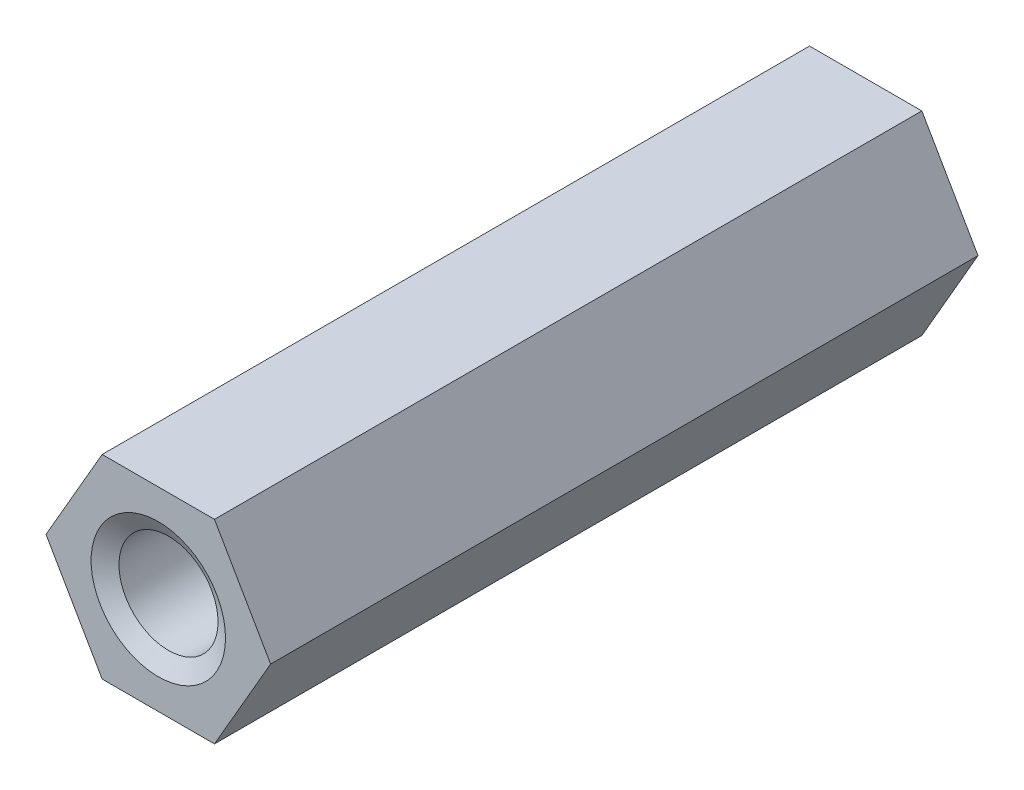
ISO-10303-21;
HEADER;
FILE_DESCRIPTION(('STEP AP214'),'2;1');
FILE_NAME('part.step','',(''),(''),'','','');
FILE_SCHEMA(('AUTOMOTIVE_DESIGN { 1 0 10303 214 1 1 1 1 }'));
ENDSEC;
DATA;
#1=APPLICATION_CONTEXT('core data for automotive mechanical design processes');
#2=APPLICATION_PROTOCOL_DEFINITION('international standard','automotive_design',2000,#1);
#3=PRODUCT_CONTEXT('',#1,'mechanical');
#4=PRODUCT('Part','Part','',(#3));
#5=PRODUCT_RELATED_PRODUCT_CATEGORY('part','',(#4));
#6=PRODUCT_DEFINITION_FORMATION('','',#4);
#7=PRODUCT_DEFINITION_CONTEXT('part definition',#1,'design');
#8=PRODUCT_DEFINITION('design','',#6,#7);
#9=PRODUCT_DEFINITION_SHAPE('','',#8);
#10=(LENGTH_UNIT() NAMED_UNIT(*) SI_UNIT(.MILLI.,.METRE.));
#11=(NAMED_UNIT(*) PLANE_ANGLE_UNIT() SI_UNIT($,.RADIAN.));
#12=(NAMED_UNIT(*) SI_UNIT($,.STERADIAN.) SOLID_ANGLE_UNIT());
#13=UNCERTAINTY_MEASURE_WITH_UNIT(LENGTH_MEASURE(1.E-05),#10,'distance_accuracy_value','');
#14=(GEOMETRIC_REPRESENTATION_CONTEXT(3) GLOBAL_UNCERTAINTY_ASSIGNED_CONTEXT((#13)) GLOBAL_UNIT_ASSIGNED_CONTEXT((#10,
#11,#12)) REPRESENTATION_CONTEXT('',''));
#15=CARTESIAN_POINT('',(0.,0.,0.));
#16=DIRECTION('',(0.,0.,1.));
#17=DIRECTION('',(1.,0.,0.));
#18=AXIS2_PLACEMENT_3D('',#15,#16,#17);
#19=CARTESIAN_POINT('',(3.17542648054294,0.,10.));
#20=DIRECTION('',(-0.866025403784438,-0.5,0.));
#21=DIRECTION('',(0.5,-0.866025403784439,0.));
#22=AXIS2_PLACEMENT_3D('',#19,#20,#21);
#23=PLANE('',#22);
#24=DIRECTION('',(-0.5,0.866025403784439,0.));
#25=VECTOR('',#24,1.);
#26=CARTESIAN_POINT('',(3.17542648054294,0.,-10.));
#27=LINE('',#26,#25);
#28=CARTESIAN_POINT('',(3.17542648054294,0.,-10.));
#29=VERTEX_POINT('',#28);
#30=CARTESIAN_POINT('',(1.58771324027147,2.75,-10.));
#31=VERTEX_POINT('',#30);
#32=EDGE_CURVE('E132',#29,#31,#27,.T.);
#33=ORIENTED_EDGE('',*,*,#32,.T.);
#34=DIRECTION('',(0.,0.,-1.));
#35=VECTOR('',#34,1.);
#36=CARTESIAN_POINT('',(1.58771324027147,2.75,10.));
#37=LINE('',#36,#35);
#38=CARTESIAN_POINT('',(1.58771324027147,2.75,10.));
#39=VERTEX_POINT('',#38);
#40=EDGE_CURVE('E150',#39,#31,#37,.T.);
#41=ORIENTED_EDGE('',*,*,#40,.F.);
#42=DIRECTION('',(-0.5,0.866025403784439,0.));
#43=VECTOR('',#42,1.);
#44=CARTESIAN_POINT('',(3.17542648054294,0.,10.));
#45=LINE('',#44,#43);
#46=CARTESIAN_POINT('',(3.17542648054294,0.,10.));
#47=VERTEX_POINT('',#46);
#48=EDGE_CURVE('E143',#47,#39,#45,.T.);
#49=ORIENTED_EDGE('',*,*,#48,.F.);
#50=DIRECTION('',(0.,0.,-1.));
#51=VECTOR('',#50,1.);
#52=CARTESIAN_POINT('',(3.17542648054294,0.,10.));
#53=LINE('',#52,#51);
#54=EDGE_CURVE('E128',#47,#29,#53,.T.);
#55=ORIENTED_EDGE('',*,*,#54,.T.);
#56=EDGE_LOOP('',(#33,#41,#49,#55));
#57=FACE_BOUND('',#56,.T.);
#58=ADVANCED_FACE('F46',(#57),#23,.F.);
#59=CARTESIAN_POINT('',(1.58771324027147,2.75,10.));
#60=DIRECTION('',(0.,-1.,0.));
#61=DIRECTION('',(0.,0.,-1.));
#62=AXIS2_PLACEMENT_3D('',#59,#60,#61);
#63=PLANE('',#62);
#64=DIRECTION('',(-1.,0.,0.));
#65=VECTOR('',#64,1.);
#66=CARTESIAN_POINT('',(1.58771324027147,2.75,-10.));
#67=LINE('',#66,#65);
#68=CARTESIAN_POINT('',(-1.58771324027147,2.75,-10.));
#69=VERTEX_POINT('',#68);
#70=EDGE_CURVE('E135',#31,#69,#67,.T.);
#71=ORIENTED_EDGE('',*,*,#70,.T.);
#72=DIRECTION('',(0.,0.,-1.));
#73=VECTOR('',#72,1.);
#74=CARTESIAN_POINT('',(-1.58771324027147,2.75,10.));
#75=LINE('',#74,#73);
#76=CARTESIAN_POINT('',(-1.58771324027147,2.75,10.));
#77=VERTEX_POINT('',#76);
#78=EDGE_CURVE('E147',#77,#69,#75,.T.);
#79=ORIENTED_EDGE('',*,*,#78,.F.);
#80=DIRECTION('',(-1.,0.,0.));
#81=VECTOR('',#80,1.);
#82=CARTESIAN_POINT('',(1.58771324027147,2.75,10.));
#83=LINE('',#82,#81);
#84=EDGE_CURVE('E101',#39,#77,#83,.T.);
#85=ORIENTED_EDGE('',*,*,#84,.F.);
#86=ORIENTED_EDGE('',*,*,#40,.T.);
#87=EDGE_LOOP('',(#71,#79,#85,#86));
#88=FACE_BOUND('',#87,.T.);
#89=ADVANCED_FACE('F179',(#88),#63,.F.);
#90=CARTESIAN_POINT('',(-1.58771324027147,2.75,10.));
#91=DIRECTION('',(0.866025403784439,-0.5,0.));
#92=DIRECTION('',(0.5,0.866025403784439,0.));
#93=AXIS2_PLACEMENT_3D('',#90,#91,#92);
#94=PLANE('',#93);
#95=DIRECTION('',(-0.5,-0.866025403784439,0.));
#96=VECTOR('',#95,1.);
#97=CARTESIAN_POINT('',(-1.58771324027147,2.75,-10.));
#98=LINE('',#97,#96);
#99=CARTESIAN_POINT('',(-3.17542648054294,0.,-10.));
#100=VERTEX_POINT('',#99);
#101=EDGE_CURVE('E138',#69,#100,#98,.T.);
#102=ORIENTED_EDGE('',*,*,#101,.T.);
#103=DIRECTION('',(0.,0.,-1.));
#104=VECTOR('',#103,1.);
#105=CARTESIAN_POINT('',(-3.17542648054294,0.,10.));
#106=LINE('',#105,#104);
#107=CARTESIAN_POINT('',(-3.17542648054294,0.,10.));
#108=VERTEX_POINT('',#107);
#109=EDGE_CURVE('E123',#108,#100,#106,.T.);
#110=ORIENTED_EDGE('',*,*,#109,.F.);
#111=DIRECTION('',(-0.5,-0.866025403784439,0.));
#112=VECTOR('',#111,1.);
#113=CARTESIAN_POINT('',(-1.58771324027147,2.75,10.));
#114=LINE('',#113,#112);
#115=EDGE_CURVE('E114',#77,#108,#114,.T.);
#116=ORIENTED_EDGE('',*,*,#115,.F.);
#117=ORIENTED_EDGE('',*,*,#78,.T.);
#118=EDGE_LOOP('',(#102,#110,#116,#117));
#119=FACE_BOUND('',#118,.T.);
#120=ADVANCED_FACE('F185',(#119),#94,.F.);
#121=CARTESIAN_POINT('',(-3.17542648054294,0.,10.));
#122=DIRECTION('',(0.866025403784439,0.5,0.));
#123=DIRECTION('',(-0.5,0.866025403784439,0.));
#124=AXIS2_PLACEMENT_3D('',#121,#122,#123);
#125=PLANE('',#124);
#126=DIRECTION('',(0.5,-0.866025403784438,0.));
#127=VECTOR('',#126,1.);
#128=CARTESIAN_POINT('',(-3.17542648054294,0.,-10.));
#129=LINE('',#128,#127);
#130=CARTESIAN_POINT('',(-1.58771324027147,-2.75,-10.));
#131=VERTEX_POINT('',#130);
#132=EDGE_CURVE('E122',#100,#131,#129,.T.);
#133=ORIENTED_EDGE('',*,*,#132,.T.);
#134=DIRECTION('',(0.,0.,-1.));
#135=VECTOR('',#134,1.);
#136=CARTESIAN_POINT('',(-1.58771324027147,-2.75,10.));
#137=LINE('',#136,#135);
#138=CARTESIAN_POINT('',(-1.58771324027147,-2.75,10.));
#139=VERTEX_POINT('',#138);
#140=EDGE_CURVE('E119',#139,#131,#137,.T.);
#141=ORIENTED_EDGE('',*,*,#140,.F.);
#142=DIRECTION('',(0.5,-0.866025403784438,0.));
#143=VECTOR('',#142,1.);
#144=CARTESIAN_POINT('',(-3.17542648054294,0.,10.));
#145=LINE('',#144,#143);
#146=EDGE_CURVE('E108',#108,#139,#145,.T.);
#147=ORIENTED_EDGE('',*,*,#146,.F.);
#148=ORIENTED_EDGE('',*,*,#109,.T.);
#149=EDGE_LOOP('',(#133,#141,#147,#148));
#150=FACE_BOUND('',#149,.T.);
#151=ADVANCED_FACE('F120',(#150),#125,.F.);
#152=CARTESIAN_POINT('',(-1.58771324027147,-2.75,10.));
#153=DIRECTION('',(0.,1.,0.));
#154=DIRECTION('',(-1.,0.,0.));
#155=AXIS2_PLACEMENT_3D('',#152,#153,#154);
#156=PLANE('',#155);
#157=DIRECTION('',(1.,0.,0.));
#158=VECTOR('',#157,1.);
#159=CARTESIAN_POINT('',(-1.58771324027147,-2.75,-10.));
#160=LINE('',#159,#158);
#161=CARTESIAN_POINT('',(1.58771324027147,-2.75,-10.));
#162=VERTEX_POINT('',#161);
#163=EDGE_CURVE('E86',#131,#162,#160,.T.);
#164=ORIENTED_EDGE('',*,*,#163,.T.);
#165=DIRECTION('',(0.,0.,-1.));
#166=VECTOR('',#165,1.);
#167=CARTESIAN_POINT('',(1.58771324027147,-2.75,10.));
#168=LINE('',#167,#166);
#169=CARTESIAN_POINT('',(1.58771324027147,-2.75,10.));
#170=VERTEX_POINT('',#169);
#171=EDGE_CURVE('E124',#170,#162,#168,.T.);
#172=ORIENTED_EDGE('',*,*,#171,.F.);
#173=DIRECTION('',(1.,0.,0.));
#174=VECTOR('',#173,1.);
#175=CARTESIAN_POINT('',(-1.58771324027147,-2.75,10.));
#176=LINE('',#175,#174);
#177=EDGE_CURVE('E112',#139,#170,#176,.T.);
#178=ORIENTED_EDGE('',*,*,#177,.F.);
#179=ORIENTED_EDGE('',*,*,#140,.T.);
#180=EDGE_LOOP('',(#164,#172,#178,#179));
#181=FACE_BOUND('',#180,.T.);
#182=ADVANCED_FACE('F126',(#181),#156,.F.);
#183=CARTESIAN_POINT('',(1.58771324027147,-2.75,10.));
#184=DIRECTION('',(-0.866025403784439,0.5,0.));
#185=DIRECTION('',(-0.5,-0.866025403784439,0.));
#186=AXIS2_PLACEMENT_3D('',#183,#184,#185);
#187=PLANE('',#186);
#188=DIRECTION('',(0.5,0.866025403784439,0.));
#189=VECTOR('',#188,1.);
#190=CARTESIAN_POINT('',(1.58771324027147,-2.75,-10.));
#191=LINE('',#190,#189);
#192=EDGE_CURVE('E92',#162,#29,#191,.T.);
#193=ORIENTED_EDGE('',*,*,#192,.T.);
#194=ORIENTED_EDGE('',*,*,#54,.F.);
#195=DIRECTION('',(0.5,0.866025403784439,0.));
#196=VECTOR('',#195,1.);
#197=CARTESIAN_POINT('',(1.58771324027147,-2.75,10.));
#198=LINE('',#197,#196);
#199=EDGE_CURVE('E63',#170,#47,#198,.T.);
#200=ORIENTED_EDGE('',*,*,#199,.F.);
#201=ORIENTED_EDGE('',*,*,#171,.T.);
#202=EDGE_LOOP('',(#193,#194,#200,#201));
#203=FACE_BOUND('',#202,.T.);
#204=ADVANCED_FACE('F216',(#203),#187,.F.);
#205=CARTESIAN_POINT('',(0.,0.,10.));
#206=DIRECTION('',(0.,0.,1.));
#207=DIRECTION('',(1.,0.,0.));
#208=AXIS2_PLACEMENT_3D('',#205,#206,#207);
#209=PLANE('',#208);
#210=CARTESIAN_POINT('',(0.,0.,10.));
#211=DIRECTION('',(0.,0.,1.));
#212=DIRECTION('',(1.,0.,0.));
#213=AXIS2_PLACEMENT_3D('',#210,#211,#212);
#214=CIRCLE('',#213,1.9);
#215=CARTESIAN_POINT('',(1.9,0.,10.));
#216=VERTEX_POINT('',#215);
#217=EDGE_CURVE('E13',#216,#216,#214,.F.);
#218=ORIENTED_EDGE('',*,*,#217,.T.);
#219=EDGE_LOOP('',(#218));
#220=FACE_BOUND('',#219,.T.);
#221=ORIENTED_EDGE('',*,*,#48,.T.);
#222=ORIENTED_EDGE('',*,*,#84,.T.);
#223=ORIENTED_EDGE('',*,*,#115,.T.);
#224=ORIENTED_EDGE('',*,*,#146,.T.);
#225=ORIENTED_EDGE('',*,*,#177,.T.);
#226=ORIENTED_EDGE('',*,*,#199,.T.);
#227=EDGE_LOOP('',(#221,#222,#223,#224,#225,#226));
#228=FACE_BOUND('',#227,.T.);
#229=ADVANCED_FACE('F110',(#220,#228),#209,.T.);
#230=CARTESIAN_POINT('',(0.,0.,-10.));
#231=DIRECTION('',(0.,0.,1.));
#232=DIRECTION('',(1.,0.,0.));
#233=AXIS2_PLACEMENT_3D('',#230,#231,#232);
#234=PLANE('',#233);
#235=CARTESIAN_POINT('',(0.,0.,-10.));
#236=DIRECTION('',(0.,0.,1.));
#237=DIRECTION('',(1.,0.,0.));
#238=AXIS2_PLACEMENT_3D('',#235,#236,#237);
#239=CIRCLE('',#238,1.68867513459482);
#240=CARTESIAN_POINT('',(1.68867513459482,0.,-10.));
#241=VERTEX_POINT('',#240);
#242=EDGE_CURVE('E158',#241,#241,#239,.T.);
#243=ORIENTED_EDGE('',*,*,#242,.T.);
#244=EDGE_LOOP('',(#243));
#245=FACE_BOUND('',#244,.T.);
#246=ORIENTED_EDGE('',*,*,#32,.F.);
#247=ORIENTED_EDGE('',*,*,#192,.F.);
#248=ORIENTED_EDGE('',*,*,#163,.F.);
#249=ORIENTED_EDGE('',*,*,#132,.F.);
#250=ORIENTED_EDGE('',*,*,#101,.F.);
#251=ORIENTED_EDGE('',*,*,#70,.F.);
#252=EDGE_LOOP('',(#246,#247,#248,#249,#250,#251));
#253=FACE_BOUND('',#252,.T.);
#254=ADVANCED_FACE('F211',(#245,#253),#234,.F.);
#255=CARTESIAN_POINT('',(0.,0.,4.));
#256=DIRECTION('',(0.,0.,1.));
#257=DIRECTION('',(1.,0.,0.));
#258=AXIS2_PLACEMENT_3D('',#255,#256,#257);
#259=CYLINDRICAL_SURFACE('',#258,1.4);
#260=CARTESIAN_POINT('',(0.,0.,9.71132486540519));
#261=DIRECTION('',(0.,0.,1.));
#262=DIRECTION('',(1.,0.,0.));
#263=AXIS2_PLACEMENT_3D('',#260,#261,#262);
#264=CIRCLE('',#263,1.4);
#265=CARTESIAN_POINT('',(1.4,0.,9.71132486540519));
#266=VERTEX_POINT('',#265);
#267=EDGE_CURVE('E55',#266,#266,#264,.T.);
#268=ORIENTED_EDGE('',*,*,#267,.T.);
#269=EDGE_LOOP('',(#268));
#270=FACE_BOUND('',#269,.T.);
#271=CARTESIAN_POINT('',(0.,0.,4.69282032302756));
#272=DIRECTION('',(0.,0.,1.));
#273=DIRECTION('',(1.,0.,0.));
#274=AXIS2_PLACEMENT_3D('',#271,#272,#273);
#275=CIRCLE('',#274,1.4);
#276=CARTESIAN_POINT('',(1.4,0.,4.69282032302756));
#277=VERTEX_POINT('',#276);
#278=EDGE_CURVE('E155',#277,#277,#275,.F.);
#279=ORIENTED_EDGE('',*,*,#278,.T.);
#280=EDGE_LOOP('',(#279));
#281=FACE_BOUND('',#280,.T.);
#282=ADVANCED_FACE('F166',(#270,#281),#259,.F.);
#283=CARTESIAN_POINT('',(0.,0.,4.));
#284=DIRECTION('',(0.,0.,1.));
#285=DIRECTION('',(1.,0.,0.));
#286=AXIS2_PLACEMENT_3D('',#283,#284,#285);
#287=PLANE('',#286);
#288=CARTESIAN_POINT('',(0.,0.,4.));
#289=DIRECTION('',(0.,0.,1.));
#290=DIRECTION('',(1.,0.,0.));
#291=AXIS2_PLACEMENT_3D('',#288,#289,#290);
#292=CIRCLE('',#291,0.199999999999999);
#293=CARTESIAN_POINT('',(0.199999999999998,0.,4.));
#294=VERTEX_POINT('',#293);
#295=EDGE_CURVE('E152',#294,#294,#292,.T.);
#296=ORIENTED_EDGE('',*,*,#295,.T.);
#297=EDGE_LOOP('',(#296));
#298=FACE_BOUND('',#297,.T.);
#299=ADVANCED_FACE('F202',(#298),#287,.T.);
#300=CARTESIAN_POINT('',(0.,0.,-4.));
#301=DIRECTION('',(0.,0.,-1.));
#302=DIRECTION('',(-1.,0.,0.));
#303=AXIS2_PLACEMENT_3D('',#300,#301,#302);
#304=CYLINDRICAL_SURFACE('',#303,1.4);
#305=CARTESIAN_POINT('',(0.,0.,-9.49999999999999));
#306=DIRECTION('',(0.,0.,1.));
#307=DIRECTION('',(1.,0.,0.));
#308=AXIS2_PLACEMENT_3D('',#305,#306,#307);
#309=CIRCLE('',#308,1.4);
#310=CARTESIAN_POINT('',(1.4,0.,-9.49999999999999));
#311=VERTEX_POINT('',#310);
#312=EDGE_CURVE('E161',#311,#311,#309,.F.);
#313=ORIENTED_EDGE('',*,*,#312,.T.);
#314=EDGE_LOOP('',(#313));
#315=FACE_BOUND('',#314,.T.);
#316=CARTESIAN_POINT('',(0.,0.,-4.));
#317=DIRECTION('',(0.,0.,1.));
#318=DIRECTION('',(1.,0.,0.));
#319=AXIS2_PLACEMENT_3D('',#316,#317,#318);
#320=CIRCLE('',#319,1.4);
#321=CARTESIAN_POINT('',(1.4,0.,-4.));
#322=VERTEX_POINT('',#321);
#323=EDGE_CURVE('E136',#322,#322,#320,.T.);
#324=ORIENTED_EDGE('',*,*,#323,.T.);
#325=EDGE_LOOP('',(#324));
#326=FACE_BOUND('',#325,.T.);
#327=ADVANCED_FACE('F195',(#315,#326),#304,.F.);
#328=CARTESIAN_POINT('',(0.,0.,-4.));
#329=DIRECTION('',(0.,0.,-1.));
#330=DIRECTION('',(1.,0.,0.));
#331=AXIS2_PLACEMENT_3D('',#328,#329,#330);
#332=PLANE('',#331);
#333=ORIENTED_EDGE('',*,*,#323,.F.);
#334=EDGE_LOOP('',(#333));
#335=FACE_BOUND('',#334,.T.);
#336=ADVANCED_FACE('F190',(#335),#332,.T.);
#337=CARTESIAN_POINT('',(0.,0.,4.));
#338=DIRECTION('',(0.,0.,1.));
#339=DIRECTION('',(1.,0.,0.));
#340=AXIS2_PLACEMENT_3D('',#337,#338,#339);
#341=CONICAL_SURFACE('',#340,0.199999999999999,1.04719755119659);
#342=CARTESIAN_POINT('',(1.4,0.,4.69282032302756));
#343=CARTESIAN_POINT('',(1.3875,0.,4.68560344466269));
#344=CARTESIAN_POINT('',(1.375,0.,4.67838656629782));
#345=CARTESIAN_POINT('',(1.35,0.,4.66395280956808));
#346=CARTESIAN_POINT('',(1.3375,0.,4.65673593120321));
#347=CARTESIAN_POINT('',(1.3125,0.,4.64230217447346));
#348=CARTESIAN_POINT('',(1.3,0.,4.63508529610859));
#349=CARTESIAN_POINT('',(1.275,0.,4.62065153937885));
#350=CARTESIAN_POINT('',(1.2625,0.,4.61343466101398));
#351=CARTESIAN_POINT('',(1.2375,0.,4.59900090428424));
#352=CARTESIAN_POINT('',(1.225,0.,4.59178402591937));
#353=CARTESIAN_POINT('',(1.2,0.,4.57735026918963));
#354=CARTESIAN_POINT('',(1.1875,0.,4.57013339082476));
#355=CARTESIAN_POINT('',(1.1625,0.,4.55569963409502));
#356=CARTESIAN_POINT('',(1.15,0.,4.54848275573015));
#357=CARTESIAN_POINT('',(1.125,0.,4.53404899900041));
#358=CARTESIAN_POINT('',(1.1125,0.,4.52683212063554));
#359=CARTESIAN_POINT('',(1.0875,0.,4.5123983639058));
#360=CARTESIAN_POINT('',(1.075,0.,4.50518148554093));
#361=CARTESIAN_POINT('',(1.05,0.,4.49074772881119));
#362=CARTESIAN_POINT('',(1.0375,0.,4.48353085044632));
#363=CARTESIAN_POINT('',(1.0125,0.,4.46909709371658));
#364=CARTESIAN_POINT('',(0.999999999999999,0.,4.46188021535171));
#365=CARTESIAN_POINT('',(0.974999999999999,0.,4.44744645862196));
#366=CARTESIAN_POINT('',(0.962499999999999,0.,4.44022958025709));
#367=CARTESIAN_POINT('',(0.937499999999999,0.,4.42579582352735));
#368=CARTESIAN_POINT('',(0.924999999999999,0.,4.41857894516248));
#369=CARTESIAN_POINT('',(0.899999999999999,0.,4.40414518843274));
#370=CARTESIAN_POINT('',(0.887499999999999,0.,4.39692831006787));
#371=CARTESIAN_POINT('',(0.862499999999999,0.,4.38249455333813));
#372=CARTESIAN_POINT('',(0.849999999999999,0.,4.37527767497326));
#373=CARTESIAN_POINT('',(0.824999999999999,0.,4.36084391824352));
#374=CARTESIAN_POINT('',(0.812499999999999,0.,4.35362703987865));
#375=CARTESIAN_POINT('',(0.787499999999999,0.,4.33919328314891));
#376=CARTESIAN_POINT('',(0.774999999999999,0.,4.33197640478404));
#377=CARTESIAN_POINT('',(0.749999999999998,0.,4.3175426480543));
#378=CARTESIAN_POINT('',(0.737499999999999,0.,4.31032576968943));
#379=CARTESIAN_POINT('',(0.712499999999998,0.,4.29589201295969));
#380=CARTESIAN_POINT('',(0.699999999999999,0.,4.28867513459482));
#381=CARTESIAN_POINT('',(0.674999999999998,0.,4.27424137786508));
#382=CARTESIAN_POINT('',(0.662499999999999,0.,4.2670244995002));
#383=CARTESIAN_POINT('',(0.637499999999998,0.,4.25259074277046));
#384=CARTESIAN_POINT('',(0.624999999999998,0.,4.24537386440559));
#385=CARTESIAN_POINT('',(0.599999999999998,0.,4.23094010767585));
#386=CARTESIAN_POINT('',(0.587499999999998,0.,4.22372322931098));
#387=CARTESIAN_POINT('',(0.562499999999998,0.,4.20928947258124));
#388=CARTESIAN_POINT('',(0.549999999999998,0.,4.20207259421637));
#389=CARTESIAN_POINT('',(0.524999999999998,0.,4.18763883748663));
#390=CARTESIAN_POINT('',(0.512499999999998,0.,4.18042195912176));
#391=CARTESIAN_POINT('',(0.487499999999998,0.,4.16598820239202));
#392=CARTESIAN_POINT('',(0.474999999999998,0.,4.15877132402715));
#393=CARTESIAN_POINT('',(0.449999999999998,0.,4.14433756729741));
#394=CARTESIAN_POINT('',(0.437499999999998,0.,4.13712068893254));
#395=CARTESIAN_POINT('',(0.412499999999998,0.,4.1226869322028));
#396=CARTESIAN_POINT('',(0.399999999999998,0.,4.11547005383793));
#397=CARTESIAN_POINT('',(0.374999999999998,0.,4.10103629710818));
#398=CARTESIAN_POINT('',(0.362499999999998,0.,4.09381941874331));
#399=CARTESIAN_POINT('',(0.337499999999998,0.,4.07938566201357));
#400=CARTESIAN_POINT('',(0.324999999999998,0.,4.0721687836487));
#401=CARTESIAN_POINT('',(0.299999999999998,0.,4.05773502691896));
#402=CARTESIAN_POINT('',(0.287499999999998,0.,4.05051814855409));
#403=CARTESIAN_POINT('',(0.262499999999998,0.,4.03608439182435));
#404=CARTESIAN_POINT('',(0.249999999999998,0.,4.02886751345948));
#405=CARTESIAN_POINT('',(0.224999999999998,0.,4.01443375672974));
#406=CARTESIAN_POINT('',(0.212499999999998,0.,4.00721687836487));
#407=CARTESIAN_POINT('',(0.199999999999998,0.,4.));
#408=B_SPLINE_CURVE_WITH_KNOTS('',3,(#342,#343,#344,#345,#346,#347,#348,#349,#350,#351,#352,
#353,#354,#355,#356,#357,#358,#359,#360,#361,#362,#363,#364,#365,#366,#367,#368,#369,#370,#371,
#372,#373,#374,#375,#376,#377,#378,#379,#380,#381,#382,#383,#384,#385,#386,#387,#388,#389,#390,
#391,#392,#393,#394,#395,#396,#397,#398,#399,#400,#401,#402,#403,#404,#405,#406,#407),
.UNSPECIFIED.,.F.,.F.,(4,2,2,2,2,2,2,2,2,2,2,2,2,2,2,2,2,2,2,2,2,2,2,2,2,2,2,2,2,2,2,2,4),(0.,
0.0433012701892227,0.0866025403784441,0.129903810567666,0.173205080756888,0.21650635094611,
0.259807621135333,0.303108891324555,0.346410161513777,0.389711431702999,0.433012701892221,
0.476313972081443,0.519615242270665,0.562916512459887,0.606217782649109,0.649519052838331,
0.692820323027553,0.736121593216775,0.779422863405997,0.822724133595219,0.866025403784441,
0.909326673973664,0.952627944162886,0.995929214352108,1.03923048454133,1.08253175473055,
1.12583302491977,1.169134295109,1.21243556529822,1.25573683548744,1.29903810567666,
1.34233937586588,1.38564064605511),.UNSPECIFIED.);
#409=EDGE_CURVE('BSEAM175',#277,#294,#408,.T.);
#410=ORIENTED_EDGE('',*,*,#278,.F.);
#411=ORIENTED_EDGE('',*,*,#295,.F.);
#412=ORIENTED_EDGE('',*,*,#409,.T.);
#413=ORIENTED_EDGE('',*,*,#409,.F.);
#414=EDGE_LOOP('',(#410,#412,#411,#413));
#415=FACE_BOUND('',#414,.T.);
#416=ADVANCED_FACE('F175',(#415),#341,.F.);
#417=CARTESIAN_POINT('',(0.,0.,-10.));
#418=DIRECTION('',(0.,0.,-1.));
#419=DIRECTION('',(-1.,0.,0.));
#420=AXIS2_PLACEMENT_3D('',#417,#418,#419);
#421=CONICAL_SURFACE('',#420,1.68867513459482,0.523598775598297);
#422=ORIENTED_EDGE('',*,*,#312,.F.);
#423=EDGE_LOOP('',(#422));
#424=FACE_BOUND('',#423,.T.);
#425=ORIENTED_EDGE('',*,*,#242,.F.);
#426=EDGE_LOOP('',(#425));
#427=FACE_BOUND('',#426,.T.);
#428=ADVANCED_FACE('F170',(#424,#427),#421,.F.);
#429=CARTESIAN_POINT('',(0.,0.,9.71132486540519));
#430=DIRECTION('',(0.,0.,1.));
#431=DIRECTION('',(1.,0.,0.));
#432=AXIS2_PLACEMENT_3D('',#429,#430,#431);
#433=CONICAL_SURFACE('',#432,1.4,1.0471975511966);
#434=ORIENTED_EDGE('',*,*,#217,.F.);
#435=EDGE_LOOP('',(#434));
#436=FACE_BOUND('',#435,.T.);
#437=ORIENTED_EDGE('',*,*,#267,.F.);
#438=EDGE_LOOP('',(#437));
#439=FACE_BOUND('',#438,.T.);
#440=ADVANCED_FACE('F48',(#436,#439),#433,.F.);
#441=CLOSED_SHELL('',(#58,#89,#120,#151,#182,#204,#229,#254,#282,#299,#327,#336,#416,#428,#440));
#442=MANIFOLD_SOLID_BREP('B2',#441);
#443=ADVANCED_BREP_SHAPE_REPRESENTATION('',(#18,#442),#14);
#444=SHAPE_DEFINITION_REPRESENTATION(#9,#443);
ENDSEC;
END-ISO-10303-21;
